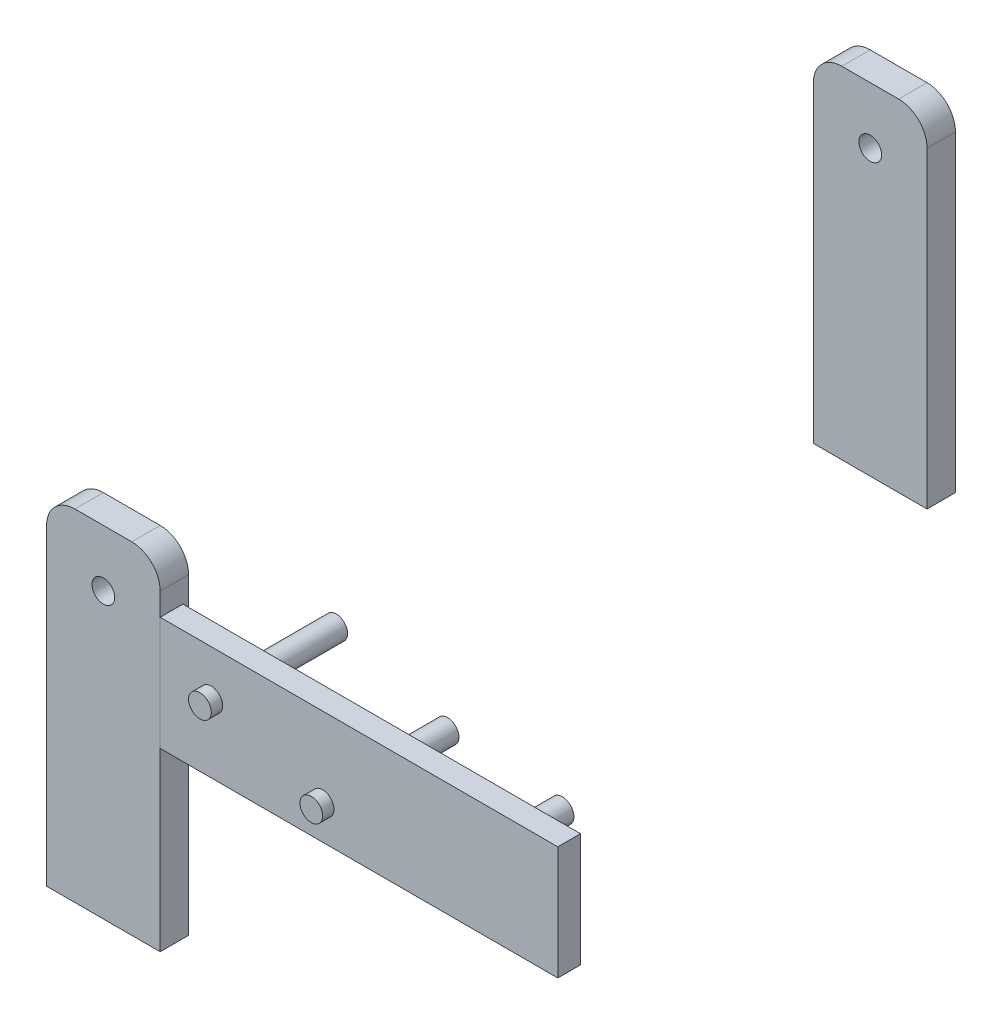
from build123d import *

# Parameters (mm, degrees)
SKETCH1_R           = 1
EXTRUDE1_DEPTH      = 2.5
SKETCH2_W           = 35
SKETCH2_H           = 10
EXTRUDE2_DEPTH      = 2
EXTRUDE3_DEPTH      = 9
EXTRUDE3_DEPTH_BACK = 3
SKETCH3_R           = 1
SKETCH4_R           = 1.018848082
EXTRUDE4_DEPTH      = 9


with BuildPart() as part:
    # Sketch1 → Extrude1 (new body)
    with BuildSketch(Plane.XY):
        with BuildLine():
            Line((44.057561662, -5), (34.057561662, -5))
            Line((34.057561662, -5), (34.057561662, 22.5))
            ThreePointArc((34.057561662, 22.5), (34.789794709, 24.267766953), (36.557561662, 25))
            Line((36.557561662, 25), (41.557561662, 25))
            ThreePointArc((41.557561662, 25), (43.325328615, 24.267766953), (44.057561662, 22.5))
            Line((44.057561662, 22.5), (44.057561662, -5))
        make_face()
        with Locations((39.057561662, 20)):
            Circle(SKETCH1_R, mode=Mode.SUBTRACT)
    extrude(amount=EXTRUDE1_DEPTH)


with BuildPart() as body_2:
    # Mirror3: mirrored copy
    add(part.part.mirror(Plane(origin=(0, 0, 35), x_dir=(1, 0, 0), z_dir=(0, 0, -1))))


with BuildPart() as body_3:
    # Sketch2 → Extrude2 (new body)
    with BuildSketch(Plane.XY.offset(70)):
        with Locations((61.557561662, 15.5)):
            Rectangle(SKETCH2_W, SKETCH2_H)
    extrude(amount=-EXTRUDE2_DEPTH)

    # Sketch3 → Extrude3 (add, two sides: drawn at the far end of the back side and taken through both)
    with BuildSketch(Plane(origin=(0, 0, 68), x_dir=(-1, 0, 0), z_dir=(0, 0, -1)).offset(-EXTRUDE3_DEPTH_BACK)):
        with Locations((-48.557561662, 16.5)):
            Circle(SKETCH3_R)
        with Locations((-58.357561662, 13.5)):
            Circle(SKETCH3_R)
    extrude(amount=EXTRUDE3_DEPTH + EXTRUDE3_DEPTH_BACK)

    # Sketch4 → Extrude4 (add)
    with BuildSketch(Plane(origin=(0, 0, 68), x_dir=(-1, 0, 0), z_dir=(0, 0, -1))):
        with Locations(Location((-68.457561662, 12.5, 0), (0, 0, 180))):
            Circle(SKETCH4_R)
    extrude(amount=EXTRUDE4_DEPTH)


solid = Compound([part.part, body_2.part, body_3.part])
